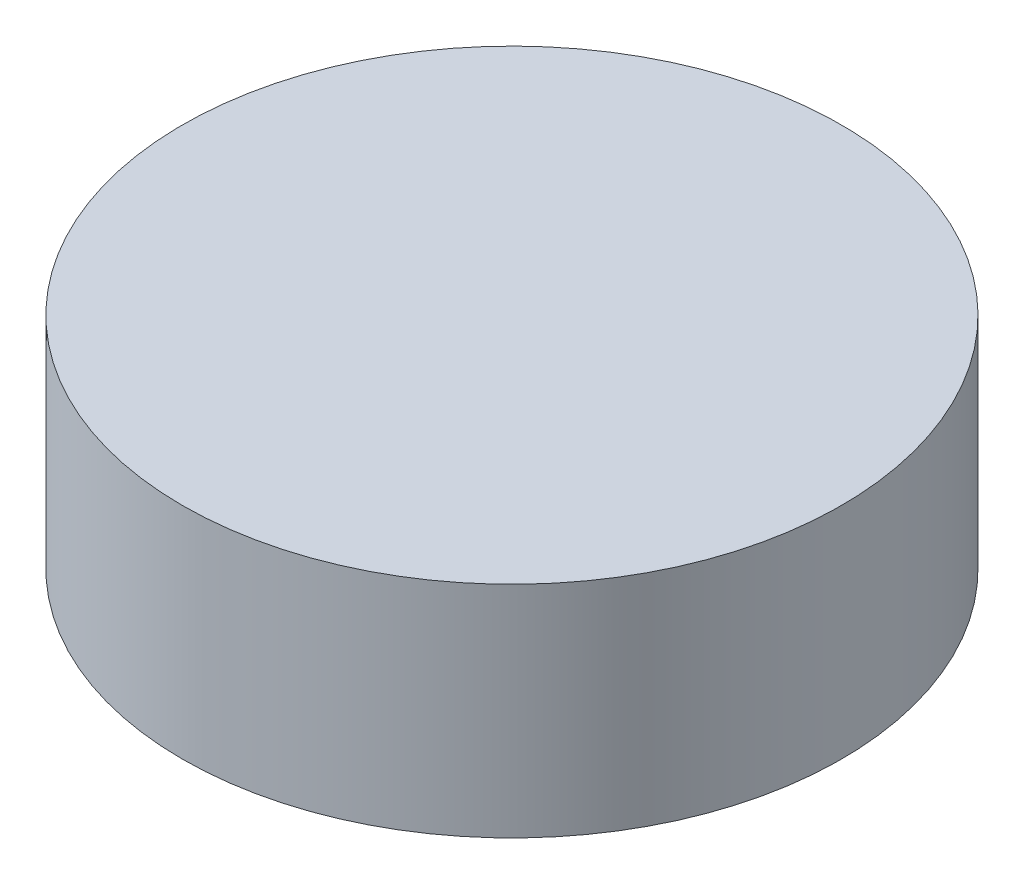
from build123d import *

# Parameters (mm, degrees)
SKIZZE1_R               = 0.75
LINEAR_AUSTRAGEN1_DEPTH = 0.5


with BuildPart() as part:
    # Skizze1 → Linear austragen1 (new body)
    with BuildSketch(Plane(origin=(0, 0, 0), x_dir=(1, 0, 0), z_dir=(0, 1, 0))):
        with Locations(Location((0, 0, 0), (0, 0, 270))):
            Circle(SKIZZE1_R)
    extrude(amount=LINEAR_AUSTRAGEN1_DEPTH)


solid = part.part
